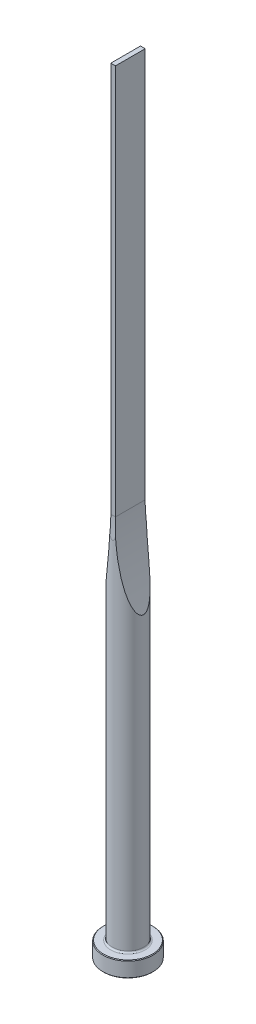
from build123d import *

# Parameters (mm, degrees)
CUT_EXTRUDE1_DEPTH = 5
CUT_EXTRUDE2_DEPTH = 5


with BuildPart() as part:
    # Sketch1 → Revolve1 (revolve)
    with BuildSketch(Plane.XY, mode=Mode.PRIVATE) as revolve1_sk:
        with BuildLine():
            Line((0, 0), (7.8, 0))
            Line((7.8, 0), (8, 0.2))
            Line((8, 0.2), (8, 4.8))
            Line((8, 4.8), (7.8, 5))
            Line((7.8, 5), (5.5, 5))
            ThreePointArc((5.5, 5), (5.146446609, 5.146446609), (5, 5.5))
            Line((5, 5.5), (5, 250))
            Line((5, 250), (0, 250))
            Line((0, 250), (0, 0))
        make_face()
    revolve(revolve1_sk.sketch.rotate(Axis((0, 250, 0), (0, -1, 0)), 180), axis=Axis((0, 250, 0), (0, -1, 0)))

    # Sketch2 → Cut-Extrude1 (cut, symmetric)
    with BuildSketch(Plane.XY):
        with BuildLine():
            Line((0.75, 250), (0.75, 125))
            ThreePointArc((0.75, 125), (1.818846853, 111.170683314), (5, 97.669842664))
            Line((5, 97.669842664), (5, 250))
            Line((5, 250), (0.75, 250))
        make_face()
        with BuildLine():
            Line((-0.75, 250), (-0.75, 125))
            ThreePointArc((-0.75, 125), (-1.818846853, 111.170683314), (-5, 97.669842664))
            Line((-5, 97.669842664), (-5, 250))
            Line((-5, 250), (-0.75, 250))
        make_face()
    extrude(amount=CUT_EXTRUDE1_DEPTH, both=True, mode=Mode.SUBTRACT)

    # Sketch3 → Cut-Extrude2 (cut, symmetric)
    with BuildSketch(Plane(origin=(0, 0, 0), x_dir=(0, 0, -1), z_dir=(1, 0, 0))):
        with BuildLine():
            Line((4.75, 250), (4.75, 125))
            ThreePointArc((4.75, 125), (4.812521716, 121.645898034), (5, 118.296456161))
            Line((5, 118.296456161), (5, 250))
            Line((5, 250), (4.75, 250))
        make_face()
        with BuildLine():
            Line((-4.75, 250), (-4.75, 125))
            ThreePointArc((-4.75, 125), (-4.812521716, 121.645898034), (-5, 118.296456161))
            Line((-5, 118.296456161), (-5, 250))
            Line((-5, 250), (-4.75, 250))
        make_face()
    extrude(amount=CUT_EXTRUDE2_DEPTH, both=True, mode=Mode.SUBTRACT)


solid = part.part
